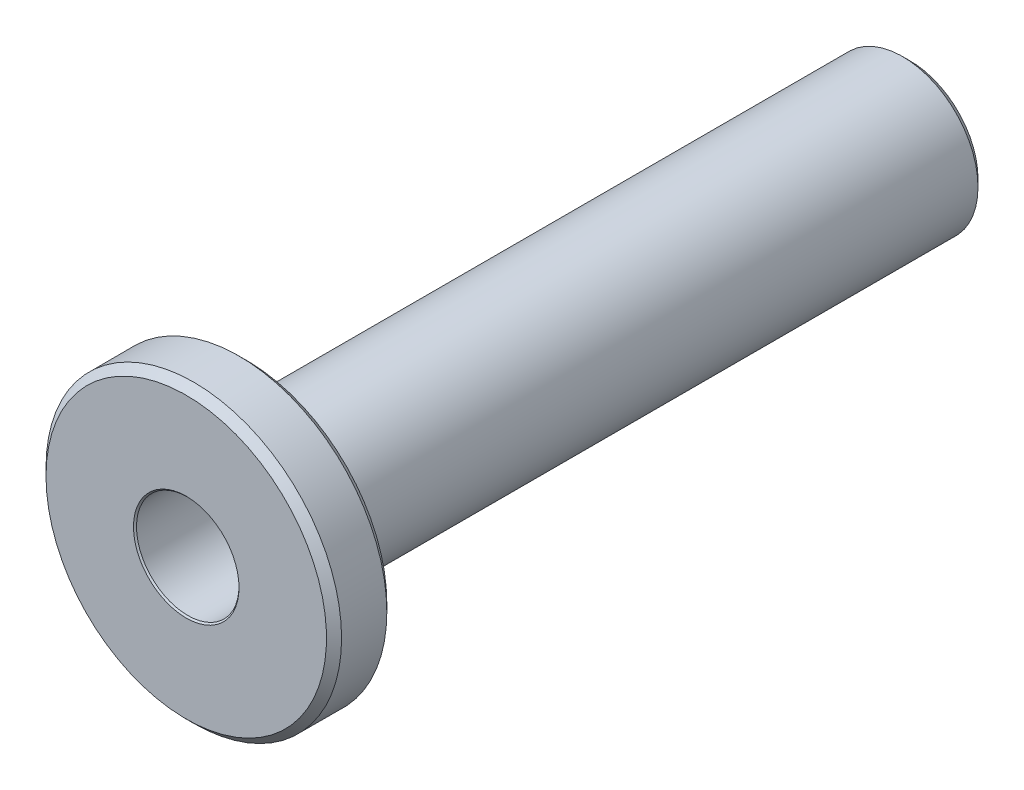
ISO-10303-21;
HEADER;
FILE_DESCRIPTION(('STEP AP214'),'2;1');
FILE_NAME('part.step','',(''),(''),'','','');
FILE_SCHEMA(('AUTOMOTIVE_DESIGN { 1 0 10303 214 1 1 1 1 }'));
ENDSEC;
DATA;
#1=APPLICATION_CONTEXT('core data for automotive mechanical design processes');
#2=APPLICATION_PROTOCOL_DEFINITION('international standard','automotive_design',2000,#1);
#3=PRODUCT_CONTEXT('',#1,'mechanical');
#4=PRODUCT('Part','Part','',(#3));
#5=PRODUCT_RELATED_PRODUCT_CATEGORY('part','',(#4));
#6=PRODUCT_DEFINITION_FORMATION('','',#4);
#7=PRODUCT_DEFINITION_CONTEXT('part definition',#1,'design');
#8=PRODUCT_DEFINITION('design','',#6,#7);
#9=PRODUCT_DEFINITION_SHAPE('','',#8);
#10=(LENGTH_UNIT() NAMED_UNIT(*) SI_UNIT(.MILLI.,.METRE.));
#11=(NAMED_UNIT(*) PLANE_ANGLE_UNIT() SI_UNIT($,.RADIAN.));
#12=(NAMED_UNIT(*) SI_UNIT($,.STERADIAN.) SOLID_ANGLE_UNIT());
#13=UNCERTAINTY_MEASURE_WITH_UNIT(LENGTH_MEASURE(1.E-05),#10,'distance_accuracy_value','');
#14=(GEOMETRIC_REPRESENTATION_CONTEXT(3) GLOBAL_UNCERTAINTY_ASSIGNED_CONTEXT((#13)) GLOBAL_UNIT_ASSIGNED_CONTEXT((#10,
#11,#12)) REPRESENTATION_CONTEXT('',''));
#15=CARTESIAN_POINT('',(0.,0.,0.));
#16=DIRECTION('',(0.,0.,1.));
#17=DIRECTION('',(1.,0.,0.));
#18=AXIS2_PLACEMENT_3D('',#15,#16,#17);
#19=CARTESIAN_POINT('',(0.,4.9,-2.));
#20=DIRECTION('',(0.,0.,1.));
#21=DIRECTION('',(1.,0.,0.));
#22=AXIS2_PLACEMENT_3D('',#19,#20,#21);
#23=PLANE('',#22);
#24=CARTESIAN_POINT('',(0.,0.,-2.));
#25=DIRECTION('',(0.,0.,1.));
#26=DIRECTION('',(1.,0.,0.));
#27=AXIS2_PLACEMENT_3D('',#24,#25,#26);
#28=CIRCLE('',#27,3.3);
#29=CARTESIAN_POINT('',(3.3,0.,-2.));
#30=VERTEX_POINT('',#29);
#31=EDGE_CURVE('E78',#30,#30,#28,.T.);
#32=ORIENTED_EDGE('',*,*,#31,.T.);
#33=EDGE_LOOP('',(#32));
#34=FACE_BOUND('',#33,.T.);
#35=CARTESIAN_POINT('',(0.,0.,-2.));
#36=DIRECTION('',(0.,0.,-1.));
#37=DIRECTION('',(1.,0.,0.));
#38=AXIS2_PLACEMENT_3D('',#35,#36,#37);
#39=CIRCLE('',#38,4.65);
#40=CARTESIAN_POINT('',(4.65,0.,-2.));
#41=VERTEX_POINT('',#40);
#42=EDGE_CURVE('E103',#41,#41,#39,.T.);
#43=ORIENTED_EDGE('',*,*,#42,.T.);
#44=EDGE_LOOP('',(#43));
#45=FACE_BOUND('',#44,.T.);
#46=ADVANCED_FACE('F54',(#34,#45),#23,.F.);
#47=CARTESIAN_POINT('',(0.,1.25,0.));
#48=DIRECTION('',(0.,0.,-1.));
#49=DIRECTION('',(0.,-1.,0.));
#50=AXIS2_PLACEMENT_3D('',#47,#48,#49);
#51=PLANE('',#50);
#52=CARTESIAN_POINT('',(0.,0.,0.));
#53=DIRECTION('',(0.,0.,-1.));
#54=DIRECTION('',(-1.,0.,0.));
#55=AXIS2_PLACEMENT_3D('',#52,#53,#54);
#56=CIRCLE('',#55,1.75);
#57=CARTESIAN_POINT('',(-1.75,0.,0.));
#58=VERTEX_POINT('',#57);
#59=EDGE_CURVE('E11',#58,#58,#56,.T.);
#60=ORIENTED_EDGE('',*,*,#59,.T.);
#61=EDGE_LOOP('',(#60));
#62=FACE_BOUND('',#61,.T.);
#63=CARTESIAN_POINT('',(0.,0.,0.));
#64=DIRECTION('',(0.,0.,1.));
#65=DIRECTION('',(-1.,0.,0.));
#66=AXIS2_PLACEMENT_3D('',#63,#64,#65);
#67=CIRCLE('',#66,4.65);
#68=CARTESIAN_POINT('',(-4.65,0.,0.));
#69=VERTEX_POINT('',#68);
#70=EDGE_CURVE('E98',#69,#69,#67,.T.);
#71=ORIENTED_EDGE('',*,*,#70,.T.);
#72=EDGE_LOOP('',(#71));
#73=FACE_BOUND('',#72,.T.);
#74=ADVANCED_FACE('F121',(#62,#73),#51,.F.);
#75=CARTESIAN_POINT('',(0.,2.5,-24.));
#76=DIRECTION('',(0.,0.,1.));
#77=DIRECTION('',(1.,0.,0.));
#78=AXIS2_PLACEMENT_3D('',#75,#76,#77);
#79=PLANE('',#78);
#80=CARTESIAN_POINT('',(0.,0.,-24.));
#81=DIRECTION('',(0.,0.,1.));
#82=DIRECTION('',(1.,0.,0.));
#83=AXIS2_PLACEMENT_3D('',#80,#81,#82);
#84=CIRCLE('',#83,1.75);
#85=CARTESIAN_POINT('',(1.75,0.,-24.));
#86=VERTEX_POINT('',#85);
#87=EDGE_CURVE('E63',#86,#86,#84,.T.);
#88=ORIENTED_EDGE('',*,*,#87,.T.);
#89=EDGE_LOOP('',(#88));
#90=FACE_BOUND('',#89,.T.);
#91=CARTESIAN_POINT('',(0.,0.,-24.));
#92=DIRECTION('',(0.,0.,-1.));
#93=DIRECTION('',(1.,0.,0.));
#94=AXIS2_PLACEMENT_3D('',#91,#92,#93);
#95=CIRCLE('',#94,2.25);
#96=CARTESIAN_POINT('',(2.25,0.,-24.));
#97=VERTEX_POINT('',#96);
#98=EDGE_CURVE('E75',#97,#97,#95,.T.);
#99=ORIENTED_EDGE('',*,*,#98,.T.);
#100=EDGE_LOOP('',(#99));
#101=FACE_BOUND('',#100,.T.);
#102=ADVANCED_FACE('F123',(#90,#101),#79,.F.);
#103=CARTESIAN_POINT('',(0.,0.,-0.5));
#104=DIRECTION('',(0.,0.,1.));
#105=DIRECTION('',(1.,0.,0.));
#106=AXIS2_PLACEMENT_3D('',#103,#104,#105);
#107=CONICAL_SURFACE('',#106,1.25,0.78539816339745);
#108=CARTESIAN_POINT('',(0.,0.,-0.050000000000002));
#109=DIRECTION('',(0.,0.,1.));
#110=DIRECTION('',(1.,0.,0.));
#111=AXIS2_PLACEMENT_3D('',#108,#109,#110);
#112=CIRCLE('',#111,1.7);
#113=CARTESIAN_POINT('',(1.7,0.,-0.050000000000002));
#114=VERTEX_POINT('',#113);
#115=EDGE_CURVE('E82',#114,#114,#112,.F.);
#116=ORIENTED_EDGE('',*,*,#115,.T.);
#117=EDGE_LOOP('',(#116));
#118=FACE_BOUND('',#117,.T.);
#119=ORIENTED_EDGE('',*,*,#59,.F.);
#120=EDGE_LOOP('',(#119));
#121=FACE_BOUND('',#120,.T.);
#122=ADVANCED_FACE('F131',(#118,#121),#107,.F.);
#123=CARTESIAN_POINT('',(0.,0.,-24.));
#124=DIRECTION('',(0.,0.,-1.));
#125=DIRECTION('',(-1.,0.,0.));
#126=AXIS2_PLACEMENT_3D('',#123,#124,#125);
#127=CONICAL_SURFACE('',#126,1.75,0.785398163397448);
#128=CARTESIAN_POINT('',(0.,0.,-23.95));
#129=DIRECTION('',(0.,0.,-1.));
#130=DIRECTION('',(-1.,0.,0.));
#131=AXIS2_PLACEMENT_3D('',#128,#129,#130);
#132=CIRCLE('',#131,1.7);
#133=CARTESIAN_POINT('',(-1.7,0.,-23.95));
#134=VERTEX_POINT('',#133);
#135=EDGE_CURVE('E79',#134,#134,#132,.F.);
#136=ORIENTED_EDGE('',*,*,#135,.T.);
#137=EDGE_LOOP('',(#136));
#138=FACE_BOUND('',#137,.T.);
#139=ORIENTED_EDGE('',*,*,#87,.F.);
#140=EDGE_LOOP('',(#139));
#141=FACE_BOUND('',#140,.T.);
#142=ADVANCED_FACE('F138',(#138,#141),#127,.F.);
#143=CARTESIAN_POINT('',(0.,0.,0.));
#144=DIRECTION('',(0.,0.,1.));
#145=DIRECTION('',(1.,0.,0.));
#146=AXIS2_PLACEMENT_3D('',#143,#144,#145);
#147=CYLINDRICAL_SURFACE('',#146,4.9);
#148=CARTESIAN_POINT('',(0.,0.,-0.25));
#149=DIRECTION('',(0.,0.,-1.));
#150=DIRECTION('',(-1.,0.,0.));
#151=AXIS2_PLACEMENT_3D('',#148,#149,#150);
#152=CIRCLE('',#151,4.9);
#153=CARTESIAN_POINT('',(-4.9,0.,-0.25));
#154=VERTEX_POINT('',#153);
#155=EDGE_CURVE('E102',#154,#154,#152,.T.);
#156=ORIENTED_EDGE('',*,*,#155,.T.);
#157=EDGE_LOOP('',(#156));
#158=FACE_BOUND('',#157,.T.);
#159=CARTESIAN_POINT('',(0.,0.,-1.75));
#160=DIRECTION('',(0.,0.,1.));
#161=DIRECTION('',(1.,0.,0.));
#162=AXIS2_PLACEMENT_3D('',#159,#160,#161);
#163=CIRCLE('',#162,4.9);
#164=CARTESIAN_POINT('',(4.9,0.,-1.75));
#165=VERTEX_POINT('',#164);
#166=EDGE_CURVE('E70',#165,#165,#163,.T.);
#167=ORIENTED_EDGE('',*,*,#166,.T.);
#168=EDGE_LOOP('',(#167));
#169=FACE_BOUND('',#168,.T.);
#170=ADVANCED_FACE('F111',(#158,#169),#147,.T.);
#171=CARTESIAN_POINT('',(0.,0.,0.));
#172=DIRECTION('',(0.,0.,1.));
#173=DIRECTION('',(1.,0.,0.));
#174=AXIS2_PLACEMENT_3D('',#171,#172,#173);
#175=CYLINDRICAL_SURFACE('',#174,2.5);
#176=CARTESIAN_POINT('',(0.,0.,-2.8));
#177=DIRECTION('',(0.,0.,-1.));
#178=DIRECTION('',(1.,0.,0.));
#179=AXIS2_PLACEMENT_3D('',#176,#177,#178);
#180=CIRCLE('',#179,2.5);
#181=CARTESIAN_POINT('',(2.5,0.,-2.8));
#182=VERTEX_POINT('',#181);
#183=EDGE_CURVE('E87',#182,#182,#180,.T.);
#184=ORIENTED_EDGE('',*,*,#183,.T.);
#185=EDGE_LOOP('',(#184));
#186=FACE_BOUND('',#185,.T.);
#187=CARTESIAN_POINT('',(0.,0.,-23.75));
#188=DIRECTION('',(0.,0.,1.));
#189=DIRECTION('',(1.,0.,0.));
#190=AXIS2_PLACEMENT_3D('',#187,#188,#189);
#191=CIRCLE('',#190,2.5);
#192=CARTESIAN_POINT('',(2.5,0.,-23.75));
#193=VERTEX_POINT('',#192);
#194=EDGE_CURVE('E58',#193,#193,#191,.T.);
#195=ORIENTED_EDGE('',*,*,#194,.T.);
#196=EDGE_LOOP('',(#195));
#197=FACE_BOUND('',#196,.T.);
#198=ADVANCED_FACE('F144',(#186,#197),#175,.T.);
#199=CARTESIAN_POINT('',(0.,0.,-1.75));
#200=DIRECTION('',(0.,0.,1.));
#201=DIRECTION('',(1.,0.,0.));
#202=AXIS2_PLACEMENT_3D('',#199,#200,#201);
#203=CONICAL_SURFACE('',#202,4.9,0.78539816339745);
#204=ORIENTED_EDGE('',*,*,#166,.F.);
#205=EDGE_LOOP('',(#204));
#206=FACE_BOUND('',#205,.T.);
#207=ORIENTED_EDGE('',*,*,#42,.F.);
#208=EDGE_LOOP('',(#207));
#209=FACE_BOUND('',#208,.T.);
#210=ADVANCED_FACE('F117',(#206,#209),#203,.T.);
#211=CARTESIAN_POINT('',(0.,0.,0.));
#212=DIRECTION('',(0.,0.,-1.));
#213=DIRECTION('',(-1.,0.,0.));
#214=AXIS2_PLACEMENT_3D('',#211,#212,#213);
#215=CONICAL_SURFACE('',#214,4.65,0.785398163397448);
#216=ORIENTED_EDGE('',*,*,#155,.F.);
#217=EDGE_LOOP('',(#216));
#218=FACE_BOUND('',#217,.T.);
#219=ORIENTED_EDGE('',*,*,#70,.F.);
#220=EDGE_LOOP('',(#219));
#221=FACE_BOUND('',#220,.T.);
#222=ADVANCED_FACE('F114',(#218,#221),#215,.T.);
#223=CARTESIAN_POINT('',(0.,0.,-23.75));
#224=DIRECTION('',(0.,0.,1.));
#225=DIRECTION('',(1.,0.,0.));
#226=AXIS2_PLACEMENT_3D('',#223,#224,#225);
#227=CONICAL_SURFACE('',#226,2.5,0.785398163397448);
#228=ORIENTED_EDGE('',*,*,#194,.F.);
#229=EDGE_LOOP('',(#228));
#230=FACE_BOUND('',#229,.T.);
#231=ORIENTED_EDGE('',*,*,#98,.F.);
#232=EDGE_LOOP('',(#231));
#233=FACE_BOUND('',#232,.T.);
#234=ADVANCED_FACE('F56',(#230,#233),#227,.T.);
#235=CARTESIAN_POINT('',(0.,0.,-2.));
#236=DIRECTION('',(0.,0.,1.));
#237=DIRECTION('',(1.,0.,0.));
#238=AXIS2_PLACEMENT_3D('',#235,#236,#237);
#239=CONICAL_SURFACE('',#238,3.3,0.785398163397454);
#240=ORIENTED_EDGE('',*,*,#31,.F.);
#241=EDGE_LOOP('',(#240));
#242=FACE_BOUND('',#241,.T.);
#243=ORIENTED_EDGE('',*,*,#183,.F.);
#244=EDGE_LOOP('',(#243));
#245=FACE_BOUND('',#244,.T.);
#246=ADVANCED_FACE('F153',(#242,#245),#239,.T.);
#247=CARTESIAN_POINT('',(0.,0.,0.));
#248=DIRECTION('',(0.,0.,-1.));
#249=DIRECTION('',(-1.,0.,0.));
#250=AXIS2_PLACEMENT_3D('',#247,#248,#249);
#251=CYLINDRICAL_SURFACE('',#250,1.7);
#252=ORIENTED_EDGE('',*,*,#135,.F.);
#253=EDGE_LOOP('',(#252));
#254=FACE_BOUND('',#253,.T.);
#255=ORIENTED_EDGE('',*,*,#115,.F.);
#256=EDGE_LOOP('',(#255));
#257=FACE_BOUND('',#256,.T.);
#258=ADVANCED_FACE('F158',(#254,#257),#251,.F.);
#259=CLOSED_SHELL('',(#46,#74,#102,#122,#142,#170,#198,#210,#222,#234,#246,#258));
#260=MANIFOLD_SOLID_BREP('B2',#259);
#261=ADVANCED_BREP_SHAPE_REPRESENTATION('',(#18,#260),#14);
#262=SHAPE_DEFINITION_REPRESENTATION(#9,#261);
ENDSEC;
END-ISO-10303-21;
